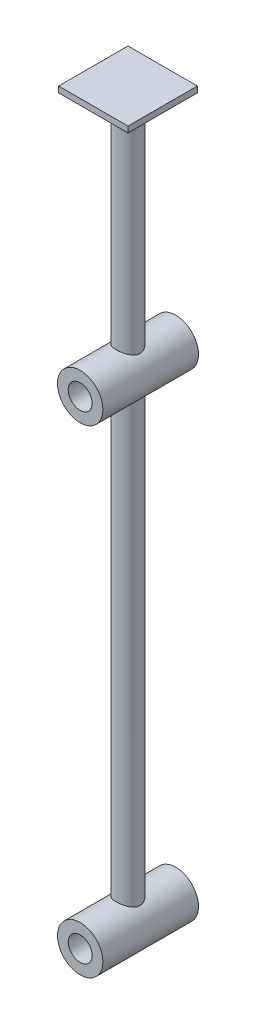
ISO-10303-21;
HEADER;
FILE_DESCRIPTION(('STEP AP214'),'2;1');
FILE_NAME('part.step','',(''),(''),'','','');
FILE_SCHEMA(('AUTOMOTIVE_DESIGN { 1 0 10303 214 1 1 1 1 }'));
ENDSEC;
DATA;
#1=APPLICATION_CONTEXT('core data for automotive mechanical design processes');
#2=APPLICATION_PROTOCOL_DEFINITION('international standard','automotive_design',2000,#1);
#3=PRODUCT_CONTEXT('',#1,'mechanical');
#4=PRODUCT('Part','Part','',(#3));
#5=PRODUCT_RELATED_PRODUCT_CATEGORY('part','',(#4));
#6=PRODUCT_DEFINITION_FORMATION('','',#4);
#7=PRODUCT_DEFINITION_CONTEXT('part definition',#1,'design');
#8=PRODUCT_DEFINITION('design','',#6,#7);
#9=PRODUCT_DEFINITION_SHAPE('','',#8);
#10=(LENGTH_UNIT() NAMED_UNIT(*) SI_UNIT(.MILLI.,.METRE.));
#11=(NAMED_UNIT(*) PLANE_ANGLE_UNIT() SI_UNIT($,.RADIAN.));
#12=(NAMED_UNIT(*) SI_UNIT($,.STERADIAN.) SOLID_ANGLE_UNIT());
#13=UNCERTAINTY_MEASURE_WITH_UNIT(LENGTH_MEASURE(1.E-05),#10,'distance_accuracy_value','');
#14=(GEOMETRIC_REPRESENTATION_CONTEXT(3) GLOBAL_UNCERTAINTY_ASSIGNED_CONTEXT((#13)) GLOBAL_UNIT_ASSIGNED_CONTEXT((#10,
#11,#12)) REPRESENTATION_CONTEXT('',''));
#15=CARTESIAN_POINT('',(0.,0.,0.));
#16=DIRECTION('',(0.,0.,1.));
#17=DIRECTION('',(1.,0.,0.));
#18=AXIS2_PLACEMENT_3D('',#15,#16,#17);
#19=CARTESIAN_POINT('',(0.,0.,40.));
#20=DIRECTION('',(0.,0.,-1.));
#21=DIRECTION('',(-1.,0.,0.));
#22=AXIS2_PLACEMENT_3D('',#19,#20,#21);
#23=CYLINDRICAL_SURFACE('',#22,19.);
#24=CARTESIAN_POINT('',(0.,0.,-40.));
#25=DIRECTION('',(0.,0.,1.));
#26=DIRECTION('',(1.,0.,0.));
#27=AXIS2_PLACEMENT_3D('',#24,#25,#26);
#28=CIRCLE('',#27,19.);
#29=CARTESIAN_POINT('',(19.,0.,-40.));
#30=VERTEX_POINT('',#29);
#31=EDGE_CURVE('E199',#30,#30,#28,.T.);
#32=ORIENTED_EDGE('',*,*,#31,.T.);
#33=EDGE_LOOP('',(#32));
#34=FACE_BOUND('',#33,.T.);
#35=CARTESIAN_POINT('',(0.,0.,40.));
#36=DIRECTION('',(0.,0.,1.));
#37=DIRECTION('',(1.,0.,0.));
#38=AXIS2_PLACEMENT_3D('',#35,#36,#37);
#39=CIRCLE('',#38,19.);
#40=CARTESIAN_POINT('',(19.,0.,40.));
#41=VERTEX_POINT('',#40);
#42=EDGE_CURVE('E203',#41,#41,#39,.T.);
#43=ORIENTED_EDGE('',*,*,#42,.F.);
#44=EDGE_LOOP('',(#43));
#45=FACE_BOUND('',#44,.T.);
#46=CARTESIAN_POINT('',(0.,19.,-10.));
#47=CARTESIAN_POINT('',(-0.261284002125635,19.0000005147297,-10.0000006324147));
#48=CARTESIAN_POINT('',(-0.522560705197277,18.9945987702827,-9.9897489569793));
#49=CARTESIAN_POINT('',(-1.04316816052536,18.9731308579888,-9.94886917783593));
#50=CARTESIAN_POINT('',(-1.30249817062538,18.957060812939,-9.91823366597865));
#51=CARTESIAN_POINT('',(-1.81751271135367,18.9146374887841,-9.8369057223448));
#52=CARTESIAN_POINT('',(-2.07319149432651,18.8882695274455,-9.78618465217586));
#53=CARTESIAN_POINT('',(-2.57867692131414,18.8259203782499,-9.66529653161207));
#54=CARTESIAN_POINT('',(-2.82848403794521,18.7899399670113,-9.59513105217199));
#55=CARTESIAN_POINT('',(-3.31961543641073,18.7094050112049,-9.43644465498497));
#56=CARTESIAN_POINT('',(-3.56096999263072,18.6648858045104,-9.34799927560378));
#57=CARTESIAN_POINT('',(-4.03485602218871,18.5682100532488,-9.15344464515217));
#58=CARTESIAN_POINT('',(-4.26738734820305,18.5160533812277,-9.04733509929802));
#59=CARTESIAN_POINT('',(-4.72235633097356,18.4052752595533,-8.81840050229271));
#60=CARTESIAN_POINT('',(-4.94479706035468,18.3466557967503,-8.69558058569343));
#61=CARTESIAN_POINT('',(-5.37873126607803,18.2241626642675,-8.43406514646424));
#62=CARTESIAN_POINT('',(-5.59022036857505,18.1602869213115,-8.29536335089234));
#63=CARTESIAN_POINT('',(-6.01460634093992,18.024353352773,-7.99353665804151));
#64=CARTESIAN_POINT('',(-6.22670849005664,17.9520335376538,-7.82941208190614));
#65=CARTESIAN_POINT('',(-6.63651342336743,17.804609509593,-7.48520583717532));
#66=CARTESIAN_POINT('',(-6.83421528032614,17.7295051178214,-7.305123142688));
#67=CARTESIAN_POINT('',(-7.21451054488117,17.5781895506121,-6.92980933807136));
#68=CARTESIAN_POINT('',(-7.39709330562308,17.5019776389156,-6.73456773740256));
#69=CARTESIAN_POINT('',(-7.74621354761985,17.3502856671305,-6.32989771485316));
#70=CARTESIAN_POINT('',(-7.91274787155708,17.2748057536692,-6.12046651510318));
#71=CARTESIAN_POINT('',(-8.24291049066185,17.1198877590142,-5.66915875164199));
#72=CARTESIAN_POINT('',(-8.40497498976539,17.0406912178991,-5.42605141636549));
#73=CARTESIAN_POINT('',(-8.70782467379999,16.8879410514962,-4.92537784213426));
#74=CARTESIAN_POINT('',(-8.84861889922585,16.8143850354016,-4.6678178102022));
#75=CARTESIAN_POINT('',(-9.10770883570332,16.6754685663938,-4.13958216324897));
#76=CARTESIAN_POINT('',(-9.22601190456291,16.6101054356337,-3.86891087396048));
#77=CARTESIAN_POINT('',(-9.43882340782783,16.4901048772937,-3.3160680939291));
#78=CARTESIAN_POINT('',(-9.53333475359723,16.4354661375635,-3.03389801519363));
#79=CARTESIAN_POINT('',(-9.69216515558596,16.342273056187,-2.47795243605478));
#80=CARTESIAN_POINT('',(-9.75799252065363,16.3029316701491,-2.20474068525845));
#81=CARTESIAN_POINT('',(-9.86658453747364,16.2374428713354,-1.65219790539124));
#82=CARTESIAN_POINT('',(-9.90935028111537,16.2112948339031,-1.3728671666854));
#83=CARTESIAN_POINT('',(-9.97107137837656,16.1734057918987,-0.810899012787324));
#84=CARTESIAN_POINT('',(-9.9900511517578,16.1616500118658,-0.528265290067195));
#85=CARTESIAN_POINT('',(-10.0039341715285,16.1530610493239,0.0378054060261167));
#86=CARTESIAN_POINT('',(-9.99884019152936,16.1562261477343,0.321242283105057));
#87=CARTESIAN_POINT('',(-9.96701770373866,16.1758715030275,0.847516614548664));
#88=CARTESIAN_POINT('',(-9.94333614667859,16.1904759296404,1.09061653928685));
#89=CARTESIAN_POINT('',(-9.8784085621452,16.230172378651,1.57367261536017));
#90=CARTESIAN_POINT('',(-9.83715681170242,16.2552678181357,1.81362771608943));
#91=CARTESIAN_POINT('',(-9.73759309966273,16.315104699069,2.28870892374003));
#92=CARTESIAN_POINT('',(-9.67928248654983,16.3498453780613,2.52383541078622));
#93=CARTESIAN_POINT('',(-9.54620984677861,16.4278977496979,2.98801042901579));
#94=CARTESIAN_POINT('',(-9.4714412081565,16.4712128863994,3.21705647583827));
#95=CARTESIAN_POINT('',(-9.30431496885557,16.5662050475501,3.67286425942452));
#96=CARTESIAN_POINT('',(-9.21160309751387,16.6180466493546,3.89946183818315));
#97=CARTESIAN_POINT('',(-9.01048616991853,16.7279495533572,4.34404850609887));
#98=CARTESIAN_POINT('',(-8.90207458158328,16.786013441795,4.56203396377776));
#99=CARTESIAN_POINT('',(-8.55432284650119,16.9673731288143,5.20181612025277));
#100=CARTESIAN_POINT('',(-8.29238326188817,17.0978858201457,5.60966156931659));
#101=CARTESIAN_POINT('',(-7.83826688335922,17.3088082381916,6.21592229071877));
#102=CARTESIAN_POINT('',(-7.66424721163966,17.3867412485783,6.42923355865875));
#103=CARTESIAN_POINT('',(-7.2993231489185,17.5430678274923,6.8407160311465));
#104=CARTESIAN_POINT('',(-7.1084231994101,17.6214612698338,7.0388911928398));
#105=CARTESIAN_POINT('',(-6.71045048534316,17.7768258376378,7.41928055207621));
#106=CARTESIAN_POINT('',(-6.5033627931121,17.8537955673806,7.60147968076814));
#107=CARTESIAN_POINT('',(-6.07417007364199,18.0043369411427,7.94862215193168));
#108=CARTESIAN_POINT('',(-5.85207093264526,18.0779098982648,8.11357219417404));
#109=CARTESIAN_POINT('',(-5.38074192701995,18.2239371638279,8.43406097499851));
#110=CARTESIAN_POINT('',(-5.13068725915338,18.2960889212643,8.58852809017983));
#111=CARTESIAN_POINT('',(-4.61627651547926,18.4326014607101,8.87562654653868));
#112=CARTESIAN_POINT('',(-4.35191965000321,18.4969618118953,9.00825668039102));
#113=CARTESIAN_POINT('',(-3.81082956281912,18.6159675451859,9.25015303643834));
#114=CARTESIAN_POINT('',(-3.53410511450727,18.6706196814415,9.35943551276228));
#115=CARTESIAN_POINT('',(-2.97021198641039,18.7685824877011,9.55336065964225));
#116=CARTESIAN_POINT('',(-2.68304466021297,18.811894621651,9.63800651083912));
#117=CARTESIAN_POINT('',(-2.12649785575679,18.882521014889,9.77510765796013));
#118=CARTESIAN_POINT('',(-1.85779198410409,18.9109115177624,9.8297481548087));
#119=CARTESIAN_POINT('',(-1.31585742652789,18.9563295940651,9.91684520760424));
#120=CARTESIAN_POINT('',(-1.04262900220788,18.9733578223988,9.9493030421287));
#121=CARTESIAN_POINT('',(-0.494073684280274,18.9955576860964,9.99157318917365));
#122=CARTESIAN_POINT('',(-0.21874782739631,19.0007348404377,10.0013960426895));
#123=CARTESIAN_POINT('',(0.331732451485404,18.9990971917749,9.9982848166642));
#124=CARTESIAN_POINT('',(0.606886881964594,18.9922830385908,9.9853519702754));
#125=CARTESIAN_POINT('',(1.13052507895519,18.9679853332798,9.93905468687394));
#126=CARTESIAN_POINT('',(1.37922572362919,18.9514930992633,9.90758769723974));
#127=CARTESIAN_POINT('',(1.87276574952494,18.9091005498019,9.82625509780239));
#128=CARTESIAN_POINT('',(2.11760541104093,18.8832009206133,9.77639083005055));
#129=CARTESIAN_POINT('',(2.60184593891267,18.8225914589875,9.65880350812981));
#130=CARTESIAN_POINT('',(2.84124652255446,18.7878811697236,9.59107952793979));
#131=CARTESIAN_POINT('',(3.31316753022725,18.7104279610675,9.43845508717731));
#132=CARTESIAN_POINT('',(3.54568765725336,18.6676846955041,9.35355388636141));
#133=CARTESIAN_POINT('',(4.00844380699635,18.5738933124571,9.16495407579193));
#134=CARTESIAN_POINT('',(4.23846905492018,18.5226606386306,9.06082997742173));
#135=CARTESIAN_POINT('',(4.68883852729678,18.4138142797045,8.83618595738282));
#136=CARTESIAN_POINT('',(4.90917927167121,18.3561983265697,8.71566020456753));
#137=CARTESIAN_POINT('',(5.55406751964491,18.1755666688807,8.3308323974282));
#138=CARTESIAN_POINT('',(5.96273573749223,18.0447135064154,8.04317505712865));
#139=CARTESIAN_POINT('',(6.77145924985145,17.7581098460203,7.37898633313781));
#140=CARTESIAN_POINT('',(7.16603086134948,17.6011898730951,6.99627261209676));
#141=CARTESIAN_POINT('',(7.70723704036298,17.3677103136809,6.37760161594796));
#142=CARTESIAN_POINT('',(7.87931390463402,17.290139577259,6.16375663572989));
#143=CARTESIAN_POINT('',(8.20577824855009,17.1376081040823,5.72194108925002));
#144=CARTESIAN_POINT('',(8.36016292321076,17.0626477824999,5.49396829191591));
#145=CARTESIAN_POINT('',(8.65941013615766,16.9128469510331,5.01005195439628));
#146=CARTESIAN_POINT('',(8.80304472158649,16.8383165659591,4.75325154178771));
#147=CARTESIAN_POINT('',(9.06779974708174,16.6972305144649,4.22633185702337));
#148=CARTESIAN_POINT('',(9.18893102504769,16.6306710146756,3.95621907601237));
#149=CARTESIAN_POINT('',(9.40731953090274,16.508119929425,3.40445109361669));
#150=CARTESIAN_POINT('',(9.50459784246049,16.4521190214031,3.12280634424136));
#151=CARTESIAN_POINT('',(9.67406007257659,16.353049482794,2.54985445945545));
#152=CARTESIAN_POINT('',(9.74624834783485,16.3099786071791,2.2585490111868));
#153=CARTESIAN_POINT('',(9.85856321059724,16.2423087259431,1.69774059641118));
#154=CARTESIAN_POINT('',(9.90113675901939,16.2163141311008,1.42889516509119));
#155=CARTESIAN_POINT('',(9.96424753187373,16.1776128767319,0.887677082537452));
#156=CARTESIAN_POINT('',(9.98478632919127,16.1649052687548,0.615304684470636));
#157=CARTESIAN_POINT('',(10.0034813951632,16.1533427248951,0.0696430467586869));
#158=CARTESIAN_POINT('',(10.0016494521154,16.1544804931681,-0.203645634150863));
#159=CARTESIAN_POINT('',(9.97566176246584,16.1705413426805,-0.748739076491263));
#160=CARTESIAN_POINT('',(9.95150735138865,16.1854635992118,-1.02054392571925));
#161=CARTESIAN_POINT('',(9.88536409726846,16.2259319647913,-1.52887206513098));
#162=CARTESIAN_POINT('',(9.84577155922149,16.2500434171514,-1.76582765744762));
#163=CARTESIAN_POINT('',(9.74992729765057,16.3077296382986,-2.23524548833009));
#164=CARTESIAN_POINT('',(9.6936701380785,16.3413074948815,-2.46770623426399));
#165=CARTESIAN_POINT('',(9.56510209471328,16.4168928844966,-2.92670680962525));
#166=CARTESIAN_POINT('',(9.49279294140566,16.4588995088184,-3.1532472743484));
#167=CARTESIAN_POINT('',(9.33278131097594,16.5501561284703,-3.59936363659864));
#168=CARTESIAN_POINT('',(9.24507274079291,16.5994089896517,-3.81893673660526));
#169=CARTESIAN_POINT('',(8.94751945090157,16.7629148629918,-4.49371460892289));
#170=CARTESIAN_POINT('',(8.71156310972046,16.8877835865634,-4.93512841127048));
#171=CARTESIAN_POINT('',(8.17907054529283,17.1519945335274,-5.77498340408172));
#172=CARTESIAN_POINT('',(7.88250172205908,17.2913445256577,-6.17340129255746));
#173=CARTESIAN_POINT('',(7.37386606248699,17.5119034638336,-6.7606006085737));
#174=CARTESIAN_POINT('',(7.18023518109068,17.5923703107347,-6.96590795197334));
#175=CARTESIAN_POINT('',(6.77605932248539,17.7519622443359,-7.3596581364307));
#176=CARTESIAN_POINT('',(6.5655194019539,17.8310877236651,-7.54810598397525));
#177=CARTESIAN_POINT('',(6.12833263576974,17.9860327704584,-7.907188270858));
#178=CARTESIAN_POINT('',(5.90167343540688,18.0618497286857,-8.07780879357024));
#179=CARTESIAN_POINT('',(5.43345572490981,18.2081771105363,-8.39989878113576));
#180=CARTESIAN_POINT('',(5.19189554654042,18.2786869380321,-8.55136609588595));
#181=CARTESIAN_POINT('',(4.69007445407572,18.4139103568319,-8.83675349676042));
#182=CARTESIAN_POINT('',(4.42953125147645,18.4784750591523,-8.97024902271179));
#183=CARTESIAN_POINT('',(3.89606361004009,18.5982625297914,-9.21448276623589));
#184=CARTESIAN_POINT('',(3.62314535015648,18.6534898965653,-9.3252321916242));
#185=CARTESIAN_POINT('',(3.06737047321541,18.7528865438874,-9.52249972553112));
#186=CARTESIAN_POINT('',(2.78453560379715,18.7970784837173,-9.60906753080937));
#187=CARTESIAN_POINT('',(2.21088063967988,18.8731460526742,-9.75703214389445));
#188=CARTESIAN_POINT('',(1.92006517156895,18.9050286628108,-9.81844322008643));
#189=CARTESIAN_POINT('',(1.3585010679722,18.9532815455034,-9.91101868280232));
#190=CARTESIAN_POINT('',(1.08820229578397,18.9707582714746,-9.9443461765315));
#191=CARTESIAN_POINT('',(0.545266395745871,18.9941173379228,-9.98883671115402));
#192=CARTESIAN_POINT('',(0.272629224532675,18.9999994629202,-9.99999934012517));
#193=CARTESIAN_POINT('',(0.,19.,-10.));
#194=B_SPLINE_CURVE_WITH_KNOTS('',3,(#46,#47,#48,#49,#50,#51,#52,#53,#54,#55,#56,#57,#58,#59,
#60,#61,#62,#63,#64,#65,#66,#67,#68,#69,#70,#71,#72,#73,#74,#75,#76,#77,#78,#79,#80,#81,#82,#83,
#84,#85,#86,#87,#88,#89,#90,#91,#92,#93,#94,#95,#96,#97,#98,#99,#100,#101,#102,#103,#104,#105,
#106,#107,#108,#109,#110,#111,#112,#113,#114,#115,#116,#117,#118,#119,#120,#121,#122,#123,#124,
#125,#126,#127,#128,#129,#130,#131,#132,#133,#134,#135,#136,#137,#138,#139,#140,#141,#142,#143,
#144,#145,#146,#147,#148,#149,#150,#151,#152,#153,#154,#155,#156,#157,#158,#159,#160,#161,#162,
#163,#164,#165,#166,#167,#168,#169,#170,#171,#172,#173,#174,#175,#176,#177,#178,#179,#180,#181,
#182,#183,#184,#185,#186,#187,#188,#189,#190,#191,#192,#193),.UNSPECIFIED.,.T.,.F.,(4,2,2,2,2,2,
2,2,2,2,2,2,2,2,2,2,2,2,2,2,2,2,2,2,2,2,2,2,2,2,2,2,2,2,2,2,2,2,2,2,2,2,2,2,2,2,2,2,2,2,2,2,2,2,
2,2,2,2,2,2,2,2,2,2,2,2,2,2,2,2,2,2,2,4),(0.,0.783584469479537,1.56745387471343,
2.35244498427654,3.13737269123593,3.91911945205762,4.70087926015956,5.48239939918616,
6.26422929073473,7.09665835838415,7.92914097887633,8.7622049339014,9.59543245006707,
10.5024590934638,11.4090991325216,12.3154420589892,13.221674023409,14.071734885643,
14.9217554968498,15.7709027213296,16.6199521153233,17.3531458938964,18.0865786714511,
18.8199534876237,19.553623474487,20.3036140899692,21.0539176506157,22.5538035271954,
23.4114231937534,24.2688178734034,25.1270127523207,25.9848730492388,26.8916087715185,
27.7983946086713,28.7045470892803,29.6105825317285,30.4364704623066,31.2623107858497,
32.087766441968,32.9131773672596,33.6659770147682,34.4187217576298,35.1715055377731,
35.9243217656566,36.6964057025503,37.4687648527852,39.0126504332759,40.7198458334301,
41.5748048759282,42.4298992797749,43.3393150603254,44.2482917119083,45.1564619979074,
46.0644745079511,46.8835924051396,47.7026518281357,48.5212796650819,49.3398585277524,
50.0633953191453,50.7871683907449,51.5108634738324,52.2348455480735,53.7760426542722,
55.318070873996,56.197603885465,57.0768748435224,57.9568271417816,58.836878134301,
59.7350141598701,60.6327065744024,61.5285402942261,62.4238652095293,63.2414585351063,
64.0590670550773),.UNSPECIFIED.);
#195=CARTESIAN_POINT('',(0.,19.,-10.));
#196=VERTEX_POINT('',#195);
#197=EDGE_CURVE('E11',#196,#196,#194,.T.);
#198=ORIENTED_EDGE('',*,*,#197,.F.);
#199=EDGE_LOOP('',(#198));
#200=FACE_BOUND('',#199,.T.);
#201=ADVANCED_FACE('F32',(#34,#45,#200),#23,.T.);
#202=CARTESIAN_POINT('',(0.,0.,40.));
#203=DIRECTION('',(0.,0.,-1.));
#204=DIRECTION('',(-1.,0.,0.));
#205=AXIS2_PLACEMENT_3D('',#202,#203,#204);
#206=CYLINDRICAL_SURFACE('',#205,10.);
#207=CARTESIAN_POINT('',(0.,0.,-40.));
#208=DIRECTION('',(0.,0.,1.));
#209=DIRECTION('',(1.,0.,0.));
#210=AXIS2_PLACEMENT_3D('',#207,#208,#209);
#211=CIRCLE('',#210,10.);
#212=CARTESIAN_POINT('',(10.,0.,-40.));
#213=VERTEX_POINT('',#212);
#214=EDGE_CURVE('E136',#213,#213,#211,.T.);
#215=ORIENTED_EDGE('',*,*,#214,.F.);
#216=EDGE_LOOP('',(#215));
#217=FACE_BOUND('',#216,.T.);
#218=CARTESIAN_POINT('',(0.,0.,40.));
#219=DIRECTION('',(0.,0.,1.));
#220=DIRECTION('',(1.,0.,0.));
#221=AXIS2_PLACEMENT_3D('',#218,#219,#220);
#222=CIRCLE('',#221,10.);
#223=CARTESIAN_POINT('',(10.,0.,40.));
#224=VERTEX_POINT('',#223);
#225=EDGE_CURVE('E345',#224,#224,#222,.T.);
#226=ORIENTED_EDGE('',*,*,#225,.T.);
#227=EDGE_LOOP('',(#226));
#228=FACE_BOUND('',#227,.T.);
#229=CARTESIAN_POINT('',(0.,0.,0.));
#230=DIRECTION('',(0.,0.707106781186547,-0.707106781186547));
#231=DIRECTION('',(0.,-0.707106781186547,-0.707106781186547));
#232=AXIS2_PLACEMENT_3D('',#229,#230,#231);
#233=ELLIPSE('',#232,14.1421356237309,10.);
#234=CARTESIAN_POINT('',(-10.,0.,0.));
#235=VERTEX_POINT('',#234);
#236=CARTESIAN_POINT('',(10.,0.,0.));
#237=VERTEX_POINT('',#236);
#238=EDGE_CURVE('E58',#235,#237,#233,.T.);
#239=ORIENTED_EDGE('',*,*,#238,.T.);
#240=CARTESIAN_POINT('',(0.,0.,0.));
#241=DIRECTION('',(0.,-0.707106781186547,-0.707106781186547));
#242=DIRECTION('',(0.,0.707106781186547,-0.707106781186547));
#243=AXIS2_PLACEMENT_3D('',#240,#241,#242);
#244=ELLIPSE('',#243,14.1421356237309,10.);
#245=EDGE_CURVE('E45',#237,#235,#244,.F.);
#246=ORIENTED_EDGE('',*,*,#245,.T.);
#247=EDGE_LOOP('',(#239,#246));
#248=FACE_BOUND('',#247,.T.);
#249=ADVANCED_FACE('F189',(#217,#228,#248),#206,.F.);
#250=CARTESIAN_POINT('',(0.,0.,40.));
#251=DIRECTION('',(0.,0.,1.));
#252=DIRECTION('',(1.,0.,0.));
#253=AXIS2_PLACEMENT_3D('',#250,#251,#252);
#254=PLANE('',#253);
#255=ORIENTED_EDGE('',*,*,#42,.T.);
#256=EDGE_LOOP('',(#255));
#257=FACE_BOUND('',#256,.T.);
#258=ORIENTED_EDGE('',*,*,#225,.F.);
#259=EDGE_LOOP('',(#258));
#260=FACE_BOUND('',#259,.T.);
#261=ADVANCED_FACE('F194',(#257,#260),#254,.T.);
#262=CARTESIAN_POINT('',(0.,0.,-40.));
#263=DIRECTION('',(0.,0.,1.));
#264=DIRECTION('',(1.,0.,0.));
#265=AXIS2_PLACEMENT_3D('',#262,#263,#264);
#266=PLANE('',#265);
#267=ORIENTED_EDGE('',*,*,#214,.T.);
#268=EDGE_LOOP('',(#267));
#269=FACE_BOUND('',#268,.T.);
#270=ORIENTED_EDGE('',*,*,#31,.F.);
#271=EDGE_LOOP('',(#270));
#272=FACE_BOUND('',#271,.T.);
#273=ADVANCED_FACE('F151',(#269,#272),#266,.F.);
#274=CARTESIAN_POINT('',(0.,600.,0.));
#275=DIRECTION('',(0.,-1.,0.));
#276=DIRECTION('',(0.,0.,-1.));
#277=AXIS2_PLACEMENT_3D('',#274,#275,#276);
#278=CYLINDRICAL_SURFACE('',#277,10.);
#279=ORIENTED_EDGE('',*,*,#245,.F.);
#280=CARTESIAN_POINT('',(0.,0.,0.));
#281=DIRECTION('',(0.,1.,0.));
#282=DIRECTION('',(0.,0.,1.));
#283=AXIS2_PLACEMENT_3D('',#280,#281,#282);
#284=CIRCLE('',#283,10.);
#285=EDGE_CURVE('E52',#237,#235,#284,.T.);
#286=ORIENTED_EDGE('',*,*,#285,.T.);
#287=EDGE_LOOP('',(#279,#286));
#288=FACE_BOUND('',#287,.T.);
#289=ADVANCED_FACE('F149',(#288),#278,.T.);
#290=CARTESIAN_POINT('',(0.,0.,0.));
#291=DIRECTION('',(0.,1.,0.));
#292=DIRECTION('',(0.,0.,1.));
#293=AXIS2_PLACEMENT_3D('',#290,#291,#292);
#294=PLANE('',#293);
#295=ORIENTED_EDGE('',*,*,#285,.F.);
#296=EDGE_CURVE('E104',#235,#237,#284,.T.);
#297=ORIENTED_EDGE('',*,*,#296,.F.);
#298=EDGE_LOOP('',(#295,#297));
#299=FACE_BOUND('',#298,.T.);
#300=ADVANCED_FACE('F147',(#299),#294,.F.);
#301=ORIENTED_EDGE('',*,*,#238,.F.);
#302=ORIENTED_EDGE('',*,*,#296,.T.);
#303=EDGE_LOOP('',(#301,#302));
#304=FACE_BOUND('',#303,.T.);
#305=ADVANCED_FACE('F141',(#304),#278,.T.);
#306=CARTESIAN_POINT('',(0.,381.,-10.));
#307=CARTESIAN_POINT('',(0.261284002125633,380.99999948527,-10.0000006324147));
#308=CARTESIAN_POINT('',(0.522560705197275,381.005401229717,-9.9897489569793));
#309=CARTESIAN_POINT('',(1.04316816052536,381.026869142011,-9.94886917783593));
#310=CARTESIAN_POINT('',(1.30249817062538,381.042939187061,-9.91823366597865));
#311=CARTESIAN_POINT('',(1.81751271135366,381.085362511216,-9.8369057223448));
#312=CARTESIAN_POINT('',(2.07319149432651,381.111730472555,-9.78618465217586));
#313=CARTESIAN_POINT('',(2.57867692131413,381.17407962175,-9.66529653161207));
#314=CARTESIAN_POINT('',(2.8284840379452,381.210060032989,-9.59513105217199));
#315=CARTESIAN_POINT('',(3.31961543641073,381.290594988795,-9.43644465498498));
#316=CARTESIAN_POINT('',(3.56096999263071,381.33511419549,-9.34799927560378));
#317=CARTESIAN_POINT('',(4.0348560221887,381.431789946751,-9.15344464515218));
#318=CARTESIAN_POINT('',(4.26738734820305,381.483946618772,-9.04733509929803));
#319=CARTESIAN_POINT('',(4.72235633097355,381.594724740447,-8.81840050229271));
#320=CARTESIAN_POINT('',(4.94479706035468,381.65334420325,-8.69558058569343));
#321=CARTESIAN_POINT('',(5.37873126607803,381.775837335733,-8.43406514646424));
#322=CARTESIAN_POINT('',(5.59022036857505,381.839713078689,-8.29536335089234));
#323=CARTESIAN_POINT('',(6.01460634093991,381.975646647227,-7.99353665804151));
#324=CARTESIAN_POINT('',(6.22670849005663,382.047966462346,-7.82941208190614));
#325=CARTESIAN_POINT('',(6.63651342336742,382.195390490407,-7.48520583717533));
#326=CARTESIAN_POINT('',(6.83421528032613,382.270494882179,-7.305123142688));
#327=CARTESIAN_POINT('',(7.21451054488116,382.421810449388,-6.92980933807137));
#328=CARTESIAN_POINT('',(7.39709330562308,382.498022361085,-6.73456773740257));
#329=CARTESIAN_POINT('',(7.74621354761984,382.64971433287,-6.32989771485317));
#330=CARTESIAN_POINT('',(7.91274787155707,382.725194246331,-6.12046651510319));
#331=CARTESIAN_POINT('',(8.24291049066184,382.880112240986,-5.669158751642));
#332=CARTESIAN_POINT('',(8.40497498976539,382.959308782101,-5.42605141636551));
#333=CARTESIAN_POINT('',(8.70782467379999,383.112058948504,-4.92537784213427));
#334=CARTESIAN_POINT('',(8.84861889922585,383.185614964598,-4.66781781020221));
#335=CARTESIAN_POINT('',(9.10770883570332,383.324531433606,-4.13958216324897));
#336=CARTESIAN_POINT('',(9.22601190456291,383.389894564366,-3.86891087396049));
#337=CARTESIAN_POINT('',(9.43882340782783,383.509895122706,-3.3160680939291));
#338=CARTESIAN_POINT('',(9.53333475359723,383.564533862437,-3.03389801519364));
#339=CARTESIAN_POINT('',(9.69216515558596,383.657726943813,-2.47795243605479));
#340=CARTESIAN_POINT('',(9.75799252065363,383.697068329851,-2.20474068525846));
#341=CARTESIAN_POINT('',(9.86658453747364,383.762557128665,-1.65219790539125));
#342=CARTESIAN_POINT('',(9.90935028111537,383.788705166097,-1.37286716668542));
#343=CARTESIAN_POINT('',(9.97107137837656,383.826594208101,-0.810899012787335));
#344=CARTESIAN_POINT('',(9.9900511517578,383.838349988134,-0.528265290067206));
#345=CARTESIAN_POINT('',(10.0039341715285,383.846938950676,0.0378054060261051));
#346=CARTESIAN_POINT('',(9.99884019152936,383.843773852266,0.321242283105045));
#347=CARTESIAN_POINT('',(9.96701770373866,383.824128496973,0.847516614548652));
#348=CARTESIAN_POINT('',(9.94333614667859,383.80952407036,1.09061653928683));
#349=CARTESIAN_POINT('',(9.8784085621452,383.769827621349,1.57367261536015));
#350=CARTESIAN_POINT('',(9.83715681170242,383.744732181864,1.81362771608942));
#351=CARTESIAN_POINT('',(9.73759309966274,383.684895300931,2.28870892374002));
#352=CARTESIAN_POINT('',(9.67928248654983,383.650154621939,2.5238354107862));
#353=CARTESIAN_POINT('',(9.54620984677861,383.572102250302,2.98801042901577));
#354=CARTESIAN_POINT('',(9.4714412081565,383.528787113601,3.21705647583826));
#355=CARTESIAN_POINT('',(9.30431496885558,383.43379495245,3.67286425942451));
#356=CARTESIAN_POINT('',(9.21160309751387,383.381953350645,3.89946183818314));
#357=CARTESIAN_POINT('',(9.01048616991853,383.272050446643,4.34404850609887));
#358=CARTESIAN_POINT('',(8.90207458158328,383.213986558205,4.56203396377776));
#359=CARTESIAN_POINT('',(8.5543228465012,383.032626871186,5.20181612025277));
#360=CARTESIAN_POINT('',(8.29238326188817,382.902114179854,5.60966156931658));
#361=CARTESIAN_POINT('',(7.83826688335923,382.691191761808,6.21592229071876));
#362=CARTESIAN_POINT('',(7.66424721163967,382.613258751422,6.42923355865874));
#363=CARTESIAN_POINT('',(7.29932314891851,382.456932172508,6.8407160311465));
#364=CARTESIAN_POINT('',(7.1084231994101,382.378538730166,7.03889119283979));
#365=CARTESIAN_POINT('',(6.71045048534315,382.223174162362,7.41928055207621));
#366=CARTESIAN_POINT('',(6.5033627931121,382.146204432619,7.60147968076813));
#367=CARTESIAN_POINT('',(6.07417007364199,381.995663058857,7.94862215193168));
#368=CARTESIAN_POINT('',(5.85207093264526,381.922090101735,8.11357219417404));
#369=CARTESIAN_POINT('',(5.38074192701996,381.776062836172,8.43406097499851));
#370=CARTESIAN_POINT('',(5.13068725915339,381.703911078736,8.58852809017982));
#371=CARTESIAN_POINT('',(4.61627651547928,381.56739853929,8.87562654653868));
#372=CARTESIAN_POINT('',(4.35191965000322,381.503038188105,9.00825668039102));
#373=CARTESIAN_POINT('',(3.81082956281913,381.384032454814,9.25015303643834));
#374=CARTESIAN_POINT('',(3.53410511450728,381.329380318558,9.35943551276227));
#375=CARTESIAN_POINT('',(2.9702119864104,381.231417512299,9.55336065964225));
#376=CARTESIAN_POINT('',(2.68304466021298,381.188105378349,9.63800651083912));
#377=CARTESIAN_POINT('',(2.12649785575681,381.117478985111,9.77510765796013));
#378=CARTESIAN_POINT('',(1.85779198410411,381.089088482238,9.82974815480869));
#379=CARTESIAN_POINT('',(1.31585742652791,381.043670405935,9.91684520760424));
#380=CARTESIAN_POINT('',(1.0426290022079,381.026642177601,9.9493030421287));
#381=CARTESIAN_POINT('',(0.49407368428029,381.004442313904,9.99157318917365));
#382=CARTESIAN_POINT('',(0.218747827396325,380.999265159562,10.0013960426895));
#383=CARTESIAN_POINT('',(-0.33173245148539,381.000902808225,9.9982848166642));
#384=CARTESIAN_POINT('',(-0.606886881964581,381.007716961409,9.9853519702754));
#385=CARTESIAN_POINT('',(-1.13052507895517,381.03201466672,9.93905468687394));
#386=CARTESIAN_POINT('',(-1.37922572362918,381.048506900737,9.90758769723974));
#387=CARTESIAN_POINT('',(-1.87276574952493,381.090899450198,9.82625509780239));
#388=CARTESIAN_POINT('',(-2.11760541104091,381.116799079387,9.77639083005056));
#389=CARTESIAN_POINT('',(-2.60184593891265,381.177408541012,9.65880350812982));
#390=CARTESIAN_POINT('',(-2.84124652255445,381.212118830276,9.5910795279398));
#391=CARTESIAN_POINT('',(-3.31316753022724,381.289572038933,9.43845508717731));
#392=CARTESIAN_POINT('',(-3.54568765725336,381.332315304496,9.35355388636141));
#393=CARTESIAN_POINT('',(-4.00844380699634,381.426106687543,9.16495407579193));
#394=CARTESIAN_POINT('',(-4.23846905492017,381.477339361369,9.06082997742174));
#395=CARTESIAN_POINT('',(-4.68883852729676,381.586185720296,8.83618595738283));
#396=CARTESIAN_POINT('',(-4.9091792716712,381.64380167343,8.71566020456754));
#397=CARTESIAN_POINT('',(-5.5540675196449,381.824433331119,8.33083239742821));
#398=CARTESIAN_POINT('',(-5.96273573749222,381.955286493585,8.04317505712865));
#399=CARTESIAN_POINT('',(-6.77145924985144,382.24189015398,7.37898633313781));
#400=CARTESIAN_POINT('',(-7.16603086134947,382.398810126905,6.99627261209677));
#401=CARTESIAN_POINT('',(-7.70723704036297,382.632289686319,6.37760161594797));
#402=CARTESIAN_POINT('',(-7.87931390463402,382.709860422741,6.16375663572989));
#403=CARTESIAN_POINT('',(-8.20577824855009,382.862391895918,5.72194108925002));
#404=CARTESIAN_POINT('',(-8.36016292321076,382.9373522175,5.49396829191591));
#405=CARTESIAN_POINT('',(-8.65941013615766,383.087153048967,5.01005195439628));
#406=CARTESIAN_POINT('',(-8.80304472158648,383.161683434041,4.75325154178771));
#407=CARTESIAN_POINT('',(-9.06779974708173,383.302769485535,4.22633185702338));
#408=CARTESIAN_POINT('',(-9.18893102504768,383.369328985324,3.95621907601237));
#409=CARTESIAN_POINT('',(-9.40731953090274,383.491880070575,3.40445109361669));
#410=CARTESIAN_POINT('',(-9.50459784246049,383.547880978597,3.12280634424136));
#411=CARTESIAN_POINT('',(-9.67406007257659,383.646950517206,2.54985445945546));
#412=CARTESIAN_POINT('',(-9.74624834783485,383.690021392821,2.25854901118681));
#413=CARTESIAN_POINT('',(-9.85856321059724,383.757691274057,1.69774059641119));
#414=CARTESIAN_POINT('',(-9.90113675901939,383.783685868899,1.4288951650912));
#415=CARTESIAN_POINT('',(-9.96424753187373,383.822387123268,0.887677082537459));
#416=CARTESIAN_POINT('',(-9.98478632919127,383.835094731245,0.615304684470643));
#417=CARTESIAN_POINT('',(-10.0034813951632,383.846657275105,0.0696430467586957));
#418=CARTESIAN_POINT('',(-10.0016494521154,383.845519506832,-0.203645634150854));
#419=CARTESIAN_POINT('',(-9.97566176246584,383.829458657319,-0.748739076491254));
#420=CARTESIAN_POINT('',(-9.95150735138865,383.814536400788,-1.02054392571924));
#421=CARTESIAN_POINT('',(-9.88536409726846,383.774068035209,-1.52887206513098));
#422=CARTESIAN_POINT('',(-9.84577155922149,383.749956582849,-1.76582765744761));
#423=CARTESIAN_POINT('',(-9.74992729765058,383.692270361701,-2.23524548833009));
#424=CARTESIAN_POINT('',(-9.6936701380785,383.658692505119,-2.46770623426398));
#425=CARTESIAN_POINT('',(-9.56510209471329,383.583107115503,-2.92670680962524));
#426=CARTESIAN_POINT('',(-9.49279294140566,383.541100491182,-3.1532472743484));
#427=CARTESIAN_POINT('',(-9.33278131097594,383.44984387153,-3.59936363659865));
#428=CARTESIAN_POINT('',(-9.24507274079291,383.400591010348,-3.81893673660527));
#429=CARTESIAN_POINT('',(-8.94751945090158,383.237085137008,-4.49371460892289));
#430=CARTESIAN_POINT('',(-8.71156310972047,383.112216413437,-4.93512841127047));
#431=CARTESIAN_POINT('',(-8.17907054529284,382.848005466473,-5.77498340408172));
#432=CARTESIAN_POINT('',(-7.88250172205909,382.708655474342,-6.17340129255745));
#433=CARTESIAN_POINT('',(-7.373866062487,382.488096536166,-6.76060060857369));
#434=CARTESIAN_POINT('',(-7.18023518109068,382.407629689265,-6.96590795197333));
#435=CARTESIAN_POINT('',(-6.77605932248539,382.248037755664,-7.3596581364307));
#436=CARTESIAN_POINT('',(-6.56551940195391,382.168912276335,-7.54810598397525));
#437=CARTESIAN_POINT('',(-6.12833263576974,382.013967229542,-7.907188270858));
#438=CARTESIAN_POINT('',(-5.90167343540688,381.938150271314,-8.07780879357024));
#439=CARTESIAN_POINT('',(-5.4334557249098,381.791822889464,-8.39989878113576));
#440=CARTESIAN_POINT('',(-5.19189554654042,381.721313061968,-8.55136609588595));
#441=CARTESIAN_POINT('',(-4.69007445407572,381.586089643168,-8.83675349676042));
#442=CARTESIAN_POINT('',(-4.42953125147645,381.521524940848,-8.97024902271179));
#443=CARTESIAN_POINT('',(-3.8960636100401,381.401737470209,-9.21448276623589));
#444=CARTESIAN_POINT('',(-3.62314535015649,381.346510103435,-9.3252321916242));
#445=CARTESIAN_POINT('',(-3.06737047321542,381.247113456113,-9.52249972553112));
#446=CARTESIAN_POINT('',(-2.78453560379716,381.202921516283,-9.60906753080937));
#447=CARTESIAN_POINT('',(-2.2108806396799,381.126853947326,-9.75703214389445));
#448=CARTESIAN_POINT('',(-1.92006517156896,381.094971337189,-9.81844322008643));
#449=CARTESIAN_POINT('',(-1.35850106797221,381.046718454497,-9.91101868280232));
#450=CARTESIAN_POINT('',(-1.08820229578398,381.029241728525,-9.9443461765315));
#451=CARTESIAN_POINT('',(-0.545266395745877,381.005882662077,-9.98883671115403));
#452=CARTESIAN_POINT('',(-0.272629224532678,381.00000053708,-9.99999934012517));
#453=CARTESIAN_POINT('',(0.,381.,-10.));
#454=B_SPLINE_CURVE_WITH_KNOTS('',3,(#306,#307,#308,#309,#310,#311,#312,#313,#314,#315,#316,
#317,#318,#319,#320,#321,#322,#323,#324,#325,#326,#327,#328,#329,#330,#331,#332,#333,#334,#335,
#336,#337,#338,#339,#340,#341,#342,#343,#344,#345,#346,#347,#348,#349,#350,#351,#352,#353,#354,
#355,#356,#357,#358,#359,#360,#361,#362,#363,#364,#365,#366,#367,#368,#369,#370,#371,#372,#373,
#374,#375,#376,#377,#378,#379,#380,#381,#382,#383,#384,#385,#386,#387,#388,#389,#390,#391,#392,
#393,#394,#395,#396,#397,#398,#399,#400,#401,#402,#403,#404,#405,#406,#407,#408,#409,#410,#411,
#412,#413,#414,#415,#416,#417,#418,#419,#420,#421,#422,#423,#424,#425,#426,#427,#428,#429,#430,
#431,#432,#433,#434,#435,#436,#437,#438,#439,#440,#441,#442,#443,#444,#445,#446,#447,#448,#449,
#450,#451,#452,#453),.UNSPECIFIED.,.T.,.F.,(4,2,2,2,2,2,2,2,2,2,2,2,2,2,2,2,2,2,2,2,2,2,2,2,2,2,
2,2,2,2,2,2,2,2,2,2,2,2,2,2,2,2,2,2,2,2,2,2,2,2,2,2,2,2,2,2,2,2,2,2,2,2,2,2,2,2,2,2,2,2,2,2,2,
4),(0.,0.783584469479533,1.56745387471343,2.35244498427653,3.13737269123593,3.91911945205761,
4.70087926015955,5.48239939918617,6.26422929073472,7.09665835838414,7.92914097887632,
8.76220493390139,9.59543245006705,10.5024590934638,11.4090991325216,12.3154420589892,
13.221674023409,14.071734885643,14.9217554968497,15.7709027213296,16.6199521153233,
17.3531458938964,18.0865786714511,18.8199534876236,19.553623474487,20.3036140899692,
21.0539176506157,22.5538035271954,23.4114231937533,24.2688178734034,25.1270127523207,
25.9848730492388,26.8916087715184,27.7983946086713,28.7045470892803,29.6105825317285,
30.4364704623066,31.2623107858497,32.087766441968,32.9131773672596,33.6659770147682,
34.4187217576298,35.1715055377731,35.9243217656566,36.6964057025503,37.4687648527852,
39.0126504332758,40.7198458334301,41.5748048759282,42.4298992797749,43.3393150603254,
44.2482917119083,45.1564619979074,46.0644745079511,46.8835924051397,47.7026518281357,
48.5212796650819,49.3398585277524,50.0633953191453,50.7871683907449,51.5108634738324,
52.2348455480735,53.7760426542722,55.318070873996,56.197603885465,57.0768748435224,
57.9568271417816,58.836878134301,59.7350141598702,60.6327065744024,61.5285402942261,
62.4238652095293,63.2414585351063,64.0590670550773),.UNSPECIFIED.);
#455=CARTESIAN_POINT('',(0.,381.,-10.));
#456=VERTEX_POINT('',#455);
#457=EDGE_CURVE('E113',#456,#456,#454,.T.);
#458=ORIENTED_EDGE('',*,*,#457,.T.);
#459=EDGE_LOOP('',(#458));
#460=FACE_BOUND('',#459,.T.);
#461=ORIENTED_EDGE('',*,*,#197,.T.);
#462=EDGE_LOOP('',(#461));
#463=FACE_BOUND('',#462,.T.);
#464=ADVANCED_FACE('F146',(#460,#463),#278,.T.);
#465=CARTESIAN_POINT('',(0.,400.,-93.7401153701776));
#466=DIRECTION('',(0.,0.,1.));
#467=DIRECTION('',(1.,0.,0.));
#468=AXIS2_PLACEMENT_3D('',#465,#466,#467);
#469=CYLINDRICAL_SURFACE('',#468,19.);
#470=ORIENTED_EDGE('',*,*,#457,.F.);
#471=EDGE_LOOP('',(#470));
#472=FACE_BOUND('',#471,.T.);
#473=CARTESIAN_POINT('',(0.,400.,-40.));
#474=DIRECTION('',(0.,0.,1.));
#475=DIRECTION('',(1.,0.,0.));
#476=AXIS2_PLACEMENT_3D('',#473,#474,#475);
#477=CIRCLE('',#476,19.);
#478=CARTESIAN_POINT('',(19.,400.,-40.));
#479=VERTEX_POINT('',#478);
#480=EDGE_CURVE('E115',#479,#479,#477,.F.);
#481=ORIENTED_EDGE('',*,*,#480,.F.);
#482=EDGE_LOOP('',(#481));
#483=FACE_BOUND('',#482,.T.);
#484=CARTESIAN_POINT('',(0.,400.,40.));
#485=DIRECTION('',(0.,0.,1.));
#486=DIRECTION('',(1.,0.,0.));
#487=AXIS2_PLACEMENT_3D('',#484,#485,#486);
#488=CIRCLE('',#487,19.);
#489=CARTESIAN_POINT('',(19.,400.,40.));
#490=VERTEX_POINT('',#489);
#491=EDGE_CURVE('E240',#490,#490,#488,.T.);
#492=ORIENTED_EDGE('',*,*,#491,.F.);
#493=EDGE_LOOP('',(#492));
#494=FACE_BOUND('',#493,.T.);
#495=CARTESIAN_POINT('',(0.,419.,-10.));
#496=CARTESIAN_POINT('',(-0.261284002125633,419.00000051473,-10.0000006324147));
#497=CARTESIAN_POINT('',(-0.522560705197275,418.994598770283,-9.9897489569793));
#498=CARTESIAN_POINT('',(-1.04316816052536,418.973130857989,-9.94886917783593));
#499=CARTESIAN_POINT('',(-1.30249817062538,418.957060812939,-9.91823366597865));
#500=CARTESIAN_POINT('',(-1.81751271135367,418.914637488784,-9.8369057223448));
#501=CARTESIAN_POINT('',(-2.07319149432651,418.888269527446,-9.78618465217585));
#502=CARTESIAN_POINT('',(-2.57867692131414,418.82592037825,-9.66529653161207));
#503=CARTESIAN_POINT('',(-2.8284840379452,418.789939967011,-9.59513105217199));
#504=CARTESIAN_POINT('',(-3.31961543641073,418.709405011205,-9.43644465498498));
#505=CARTESIAN_POINT('',(-3.56096999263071,418.66488580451,-9.34799927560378));
#506=CARTESIAN_POINT('',(-4.0348560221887,418.568210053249,-9.15344464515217));
#507=CARTESIAN_POINT('',(-4.26738734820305,418.516053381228,-9.04733509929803));
#508=CARTESIAN_POINT('',(-4.72235633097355,418.405275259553,-8.81840050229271));
#509=CARTESIAN_POINT('',(-4.94479706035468,418.34665579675,-8.69558058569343));
#510=CARTESIAN_POINT('',(-5.37873126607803,418.224162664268,-8.43406514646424));
#511=CARTESIAN_POINT('',(-5.59022036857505,418.160286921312,-8.29536335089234));
#512=CARTESIAN_POINT('',(-6.01460634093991,418.024353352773,-7.99353665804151));
#513=CARTESIAN_POINT('',(-6.22670849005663,417.952033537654,-7.82941208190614));
#514=CARTESIAN_POINT('',(-6.63651342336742,417.804609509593,-7.48520583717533));
#515=CARTESIAN_POINT('',(-6.83421528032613,417.729505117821,-7.305123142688));
#516=CARTESIAN_POINT('',(-7.21451054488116,417.578189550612,-6.92980933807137));
#517=CARTESIAN_POINT('',(-7.39709330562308,417.501977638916,-6.73456773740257));
#518=CARTESIAN_POINT('',(-7.74621354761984,417.35028566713,-6.32989771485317));
#519=CARTESIAN_POINT('',(-7.91274787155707,417.274805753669,-6.12046651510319));
#520=CARTESIAN_POINT('',(-8.24291049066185,417.119887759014,-5.66915875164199));
#521=CARTESIAN_POINT('',(-8.40497498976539,417.040691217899,-5.42605141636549));
#522=CARTESIAN_POINT('',(-8.7078246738,416.887941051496,-4.92537784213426));
#523=CARTESIAN_POINT('',(-8.84861889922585,416.814385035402,-4.6678178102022));
#524=CARTESIAN_POINT('',(-9.10770883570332,416.675468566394,-4.13958216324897));
#525=CARTESIAN_POINT('',(-9.22601190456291,416.610105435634,-3.86891087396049));
#526=CARTESIAN_POINT('',(-9.43882340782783,416.490104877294,-3.3160680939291));
#527=CARTESIAN_POINT('',(-9.53333475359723,416.435466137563,-3.03389801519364));
#528=CARTESIAN_POINT('',(-9.69216515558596,416.342273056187,-2.47795243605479));
#529=CARTESIAN_POINT('',(-9.75799252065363,416.302931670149,-2.20474068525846));
#530=CARTESIAN_POINT('',(-9.86658453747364,416.237442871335,-1.65219790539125));
#531=CARTESIAN_POINT('',(-9.90935028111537,416.211294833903,-1.37286716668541));
#532=CARTESIAN_POINT('',(-9.97107137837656,416.173405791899,-0.810899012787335));
#533=CARTESIAN_POINT('',(-9.9900511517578,416.161650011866,-0.528265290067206));
#534=CARTESIAN_POINT('',(-10.0039341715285,416.153061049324,0.0378054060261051));
#535=CARTESIAN_POINT('',(-9.99884019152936,416.156226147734,0.321242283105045));
#536=CARTESIAN_POINT('',(-9.96701770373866,416.175871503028,0.847516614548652));
#537=CARTESIAN_POINT('',(-9.94333614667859,416.19047592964,1.09061653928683));
#538=CARTESIAN_POINT('',(-9.8784085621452,416.230172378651,1.57367261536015));
#539=CARTESIAN_POINT('',(-9.83715681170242,416.255267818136,1.81362771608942));
#540=CARTESIAN_POINT('',(-9.73759309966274,416.315104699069,2.28870892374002));
#541=CARTESIAN_POINT('',(-9.67928248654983,416.349845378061,2.5238354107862));
#542=CARTESIAN_POINT('',(-9.54620984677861,416.427897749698,2.98801042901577));
#543=CARTESIAN_POINT('',(-9.4714412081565,416.471212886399,3.21705647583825));
#544=CARTESIAN_POINT('',(-9.30431496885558,416.56620504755,3.67286425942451));
#545=CARTESIAN_POINT('',(-9.21160309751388,416.618046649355,3.89946183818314));
#546=CARTESIAN_POINT('',(-9.01048616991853,416.727949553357,4.34404850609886));
#547=CARTESIAN_POINT('',(-8.90207458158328,416.786013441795,4.56203396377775));
#548=CARTESIAN_POINT('',(-8.5543228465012,416.967373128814,5.20181612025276));
#549=CARTESIAN_POINT('',(-8.29238326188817,417.097885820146,5.60966156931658));
#550=CARTESIAN_POINT('',(-7.83826688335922,417.308808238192,6.21592229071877));
#551=CARTESIAN_POINT('',(-7.66424721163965,417.386741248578,6.42923355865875));
#552=CARTESIAN_POINT('',(-7.29932314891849,417.543067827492,6.84071603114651));
#553=CARTESIAN_POINT('',(-7.1084231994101,417.621461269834,7.0388911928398));
#554=CARTESIAN_POINT('',(-6.71045048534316,417.776825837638,7.41928055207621));
#555=CARTESIAN_POINT('',(-6.5033627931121,417.853795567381,7.60147968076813));
#556=CARTESIAN_POINT('',(-6.07417007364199,418.004336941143,7.94862215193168));
#557=CARTESIAN_POINT('',(-5.85207093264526,418.077909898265,8.11357219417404));
#558=CARTESIAN_POINT('',(-5.38074192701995,418.223937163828,8.43406097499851));
#559=CARTESIAN_POINT('',(-5.13068725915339,418.296088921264,8.58852809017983));
#560=CARTESIAN_POINT('',(-4.61627651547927,418.43260146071,8.87562654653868));
#561=CARTESIAN_POINT('',(-4.35191965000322,418.496961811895,9.00825668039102));
#562=CARTESIAN_POINT('',(-3.81082956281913,418.615967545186,9.25015303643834));
#563=CARTESIAN_POINT('',(-3.53410511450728,418.670619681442,9.35943551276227));
#564=CARTESIAN_POINT('',(-2.9702119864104,418.768582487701,9.55336065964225));
#565=CARTESIAN_POINT('',(-2.68304466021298,418.811894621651,9.63800651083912));
#566=CARTESIAN_POINT('',(-2.12649785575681,418.882521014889,9.77510765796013));
#567=CARTESIAN_POINT('',(-1.85779198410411,418.910911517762,9.82974815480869));
#568=CARTESIAN_POINT('',(-1.31585742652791,418.956329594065,9.91684520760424));
#569=CARTESIAN_POINT('',(-1.0426290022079,418.973357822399,9.9493030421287));
#570=CARTESIAN_POINT('',(-0.494073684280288,418.995557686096,9.99157318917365));
#571=CARTESIAN_POINT('',(-0.21874782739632,419.000734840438,10.0013960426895));
#572=CARTESIAN_POINT('',(0.331732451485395,418.999097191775,9.9982848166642));
#573=CARTESIAN_POINT('',(0.606886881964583,418.992283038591,9.9853519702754));
#574=CARTESIAN_POINT('',(1.13052507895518,418.96798533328,9.93905468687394));
#575=CARTESIAN_POINT('',(1.37922572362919,418.951493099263,9.90758769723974));
#576=CARTESIAN_POINT('',(1.87276574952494,418.909100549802,9.82625509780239));
#577=CARTESIAN_POINT('',(2.11760541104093,418.883200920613,9.77639083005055));
#578=CARTESIAN_POINT('',(2.60184593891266,418.822591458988,9.65880350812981));
#579=CARTESIAN_POINT('',(2.84124652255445,418.787881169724,9.59107952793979));
#580=CARTESIAN_POINT('',(3.31316753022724,418.710427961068,9.43845508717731));
#581=CARTESIAN_POINT('',(3.54568765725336,418.667684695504,9.35355388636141));
#582=CARTESIAN_POINT('',(4.00844380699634,418.573893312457,9.16495407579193));
#583=CARTESIAN_POINT('',(4.23846905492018,418.522660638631,9.06082997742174));
#584=CARTESIAN_POINT('',(4.68883852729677,418.413814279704,8.83618595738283));
#585=CARTESIAN_POINT('',(4.9091792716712,418.35619832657,8.71566020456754));
#586=CARTESIAN_POINT('',(5.5540675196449,418.175566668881,8.3308323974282));
#587=CARTESIAN_POINT('',(5.96273573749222,418.044713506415,8.04317505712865));
#588=CARTESIAN_POINT('',(6.77145924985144,417.75810984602,7.37898633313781));
#589=CARTESIAN_POINT('',(7.16603086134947,417.601189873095,6.99627261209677));
#590=CARTESIAN_POINT('',(7.70723704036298,417.367710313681,6.37760161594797));
#591=CARTESIAN_POINT('',(7.87931390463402,417.290139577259,6.16375663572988));
#592=CARTESIAN_POINT('',(8.2057782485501,417.137608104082,5.72194108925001));
#593=CARTESIAN_POINT('',(8.36016292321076,417.0626477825,5.4939682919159));
#594=CARTESIAN_POINT('',(8.65941013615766,416.912846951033,5.01005195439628));
#595=CARTESIAN_POINT('',(8.80304472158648,416.838316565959,4.75325154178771));
#596=CARTESIAN_POINT('',(9.06779974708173,416.697230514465,4.22633185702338));
#597=CARTESIAN_POINT('',(9.18893102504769,416.630671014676,3.95621907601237));
#598=CARTESIAN_POINT('',(9.40731953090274,416.508119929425,3.40445109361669));
#599=CARTESIAN_POINT('',(9.50459784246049,416.452119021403,3.12280634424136));
#600=CARTESIAN_POINT('',(9.67406007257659,416.353049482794,2.54985445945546));
#601=CARTESIAN_POINT('',(9.74624834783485,416.309978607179,2.25854901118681));
#602=CARTESIAN_POINT('',(9.85856321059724,416.242308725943,1.69774059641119));
#603=CARTESIAN_POINT('',(9.90113675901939,416.216314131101,1.42889516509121));
#604=CARTESIAN_POINT('',(9.96424753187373,416.177612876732,0.887677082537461));
#605=CARTESIAN_POINT('',(9.98478632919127,416.164905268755,0.615304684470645));
#606=CARTESIAN_POINT('',(10.0034813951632,416.153342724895,0.0696430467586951));
#607=CARTESIAN_POINT('',(10.0016494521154,416.154480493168,-0.203645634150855));
#608=CARTESIAN_POINT('',(9.97566176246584,416.170541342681,-0.748739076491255));
#609=CARTESIAN_POINT('',(9.95150735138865,416.185463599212,-1.02054392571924));
#610=CARTESIAN_POINT('',(9.88536409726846,416.225931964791,-1.52887206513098));
#611=CARTESIAN_POINT('',(9.84577155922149,416.250043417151,-1.76582765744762));
#612=CARTESIAN_POINT('',(9.74992729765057,416.307729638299,-2.23524548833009));
#613=CARTESIAN_POINT('',(9.6936701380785,416.341307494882,-2.46770623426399));
#614=CARTESIAN_POINT('',(9.56510209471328,416.416892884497,-2.92670680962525));
#615=CARTESIAN_POINT('',(9.49279294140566,416.458899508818,-3.15324727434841));
#616=CARTESIAN_POINT('',(9.33278131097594,416.55015612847,-3.59936363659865));
#617=CARTESIAN_POINT('',(9.24507274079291,416.599408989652,-3.81893673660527));
#618=CARTESIAN_POINT('',(8.94751945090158,416.762914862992,-4.49371460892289));
#619=CARTESIAN_POINT('',(8.71156310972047,416.887783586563,-4.93512841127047));
#620=CARTESIAN_POINT('',(8.17907054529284,417.151994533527,-5.77498340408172));
#621=CARTESIAN_POINT('',(7.88250172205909,417.291344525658,-6.17340129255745));
#622=CARTESIAN_POINT('',(7.373866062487,417.511903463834,-6.76060060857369));
#623=CARTESIAN_POINT('',(7.18023518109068,417.592370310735,-6.96590795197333));
#624=CARTESIAN_POINT('',(6.77605932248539,417.751962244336,-7.3596581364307));
#625=CARTESIAN_POINT('',(6.56551940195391,417.831087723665,-7.54810598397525));
#626=CARTESIAN_POINT('',(6.12833263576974,417.986032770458,-7.907188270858));
#627=CARTESIAN_POINT('',(5.90167343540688,418.061849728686,-8.07780879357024));
#628=CARTESIAN_POINT('',(5.4334557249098,418.208177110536,-8.39989878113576));
#629=CARTESIAN_POINT('',(5.19189554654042,418.278686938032,-8.55136609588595));
#630=CARTESIAN_POINT('',(4.69007445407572,418.413910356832,-8.83675349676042));
#631=CARTESIAN_POINT('',(4.42953125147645,418.478475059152,-8.97024902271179));
#632=CARTESIAN_POINT('',(3.8960636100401,418.598262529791,-9.21448276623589));
#633=CARTESIAN_POINT('',(3.62314535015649,418.653489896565,-9.3252321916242));
#634=CARTESIAN_POINT('',(3.06737047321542,418.752886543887,-9.52249972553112));
#635=CARTESIAN_POINT('',(2.78453560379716,418.797078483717,-9.60906753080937));
#636=CARTESIAN_POINT('',(2.2108806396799,418.873146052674,-9.75703214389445));
#637=CARTESIAN_POINT('',(1.92006517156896,418.905028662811,-9.81844322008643));
#638=CARTESIAN_POINT('',(1.35850106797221,418.953281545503,-9.91101868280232));
#639=CARTESIAN_POINT('',(1.08820229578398,418.970758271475,-9.9443461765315));
#640=CARTESIAN_POINT('',(0.545266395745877,418.994117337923,-9.98883671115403));
#641=CARTESIAN_POINT('',(0.272629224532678,418.99999946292,-9.99999934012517));
#642=CARTESIAN_POINT('',(0.,419.,-10.));
#643=B_SPLINE_CURVE_WITH_KNOTS('',3,(#495,#496,#497,#498,#499,#500,#501,#502,#503,#504,#505,
#506,#507,#508,#509,#510,#511,#512,#513,#514,#515,#516,#517,#518,#519,#520,#521,#522,#523,#524,
#525,#526,#527,#528,#529,#530,#531,#532,#533,#534,#535,#536,#537,#538,#539,#540,#541,#542,#543,
#544,#545,#546,#547,#548,#549,#550,#551,#552,#553,#554,#555,#556,#557,#558,#559,#560,#561,#562,
#563,#564,#565,#566,#567,#568,#569,#570,#571,#572,#573,#574,#575,#576,#577,#578,#579,#580,#581,
#582,#583,#584,#585,#586,#587,#588,#589,#590,#591,#592,#593,#594,#595,#596,#597,#598,#599,#600,
#601,#602,#603,#604,#605,#606,#607,#608,#609,#610,#611,#612,#613,#614,#615,#616,#617,#618,#619,
#620,#621,#622,#623,#624,#625,#626,#627,#628,#629,#630,#631,#632,#633,#634,#635,#636,#637,#638,
#639,#640,#641,#642),.UNSPECIFIED.,.T.,.F.,(4,2,2,2,2,2,2,2,2,2,2,2,2,2,2,2,2,2,2,2,2,2,2,2,2,2,
2,2,2,2,2,2,2,2,2,2,2,2,2,2,2,2,2,2,2,2,2,2,2,2,2,2,2,2,2,2,2,2,2,2,2,2,2,2,2,2,2,2,2,2,2,2,2,
4),(0.,0.783584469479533,1.56745387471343,2.35244498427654,3.13737269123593,3.91911945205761,
4.70087926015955,5.48239939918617,6.26422929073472,7.09665835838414,7.92914097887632,
8.76220493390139,9.59543245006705,10.5024590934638,11.4090991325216,12.3154420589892,
13.221674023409,14.071734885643,14.9217554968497,15.7709027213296,16.6199521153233,
17.3531458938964,18.0865786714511,18.8199534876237,19.553623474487,20.3036140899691,
21.0539176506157,22.5538035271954,23.4114231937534,24.2688178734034,25.1270127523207,
25.9848730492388,26.8916087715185,27.7983946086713,28.7045470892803,29.6105825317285,
30.4364704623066,31.2623107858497,32.087766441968,32.9131773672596,33.6659770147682,
34.4187217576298,35.1715055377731,35.9243217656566,36.6964057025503,37.4687648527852,
39.0126504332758,40.7198458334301,41.5748048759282,42.4298992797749,43.3393150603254,
44.2482917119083,45.1564619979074,46.0644745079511,46.8835924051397,47.7026518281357,
48.5212796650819,49.3398585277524,50.0633953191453,50.7871683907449,51.5108634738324,
52.2348455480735,53.7760426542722,55.318070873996,56.197603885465,57.0768748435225,
57.9568271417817,58.836878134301,59.7350141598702,60.6327065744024,61.5285402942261,
62.4238652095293,63.2414585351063,64.0590670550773),.UNSPECIFIED.);
#644=CARTESIAN_POINT('',(0.,419.,-10.));
#645=VERTEX_POINT('',#644);
#646=EDGE_CURVE('E36',#645,#645,#643,.T.);
#647=ORIENTED_EDGE('',*,*,#646,.F.);
#648=EDGE_LOOP('',(#647));
#649=FACE_BOUND('',#648,.T.);
#650=ADVANCED_FACE('F160',(#472,#483,#494,#649),#469,.T.);
#651=CARTESIAN_POINT('',(0.,400.,40.));
#652=DIRECTION('',(0.,0.,1.));
#653=DIRECTION('',(1.,0.,0.));
#654=AXIS2_PLACEMENT_3D('',#651,#652,#653);
#655=PLANE('',#654);
#656=CARTESIAN_POINT('',(0.,400.,40.));
#657=DIRECTION('',(0.,0.,1.));
#658=DIRECTION('',(1.,0.,0.));
#659=AXIS2_PLACEMENT_3D('',#656,#657,#658);
#660=CIRCLE('',#659,10.);
#661=CARTESIAN_POINT('',(10.,400.,40.));
#662=VERTEX_POINT('',#661);
#663=EDGE_CURVE('E244',#662,#662,#660,.T.);
#664=ORIENTED_EDGE('',*,*,#663,.F.);
#665=EDGE_LOOP('',(#664));
#666=FACE_BOUND('',#665,.T.);
#667=ORIENTED_EDGE('',*,*,#491,.T.);
#668=EDGE_LOOP('',(#667));
#669=FACE_BOUND('',#668,.T.);
#670=ADVANCED_FACE('F165',(#666,#669),#655,.T.);
#671=CARTESIAN_POINT('',(0.,0.,-40.));
#672=DIRECTION('',(0.,0.,1.));
#673=DIRECTION('',(1.,0.,0.));
#674=AXIS2_PLACEMENT_3D('',#671,#672,#673);
#675=PLANE('',#674);
#676=CARTESIAN_POINT('',(0.,400.,-40.));
#677=DIRECTION('',(0.,0.,1.));
#678=DIRECTION('',(1.,0.,0.));
#679=AXIS2_PLACEMENT_3D('',#676,#677,#678);
#680=CIRCLE('',#679,10.);
#681=CARTESIAN_POINT('',(10.,400.,-40.));
#682=VERTEX_POINT('',#681);
#683=EDGE_CURVE('E236',#682,#682,#680,.T.);
#684=ORIENTED_EDGE('',*,*,#683,.T.);
#685=EDGE_LOOP('',(#684));
#686=FACE_BOUND('',#685,.T.);
#687=ORIENTED_EDGE('',*,*,#480,.T.);
#688=EDGE_LOOP('',(#687));
#689=FACE_BOUND('',#688,.T.);
#690=ADVANCED_FACE('F174',(#686,#689),#675,.F.);
#691=CARTESIAN_POINT('',(29.,605.,29.));
#692=DIRECTION('',(0.,-1.,0.));
#693=DIRECTION('',(0.,0.,-1.));
#694=AXIS2_PLACEMENT_3D('',#691,#692,#693);
#695=PLANE('',#694);
#696=DIRECTION('',(0.,0.,-1.));
#697=VECTOR('',#696,1.);
#698=CARTESIAN_POINT('',(29.,605.,-29.));
#699=LINE('',#698,#697);
#700=CARTESIAN_POINT('',(29.,605.,29.));
#701=VERTEX_POINT('',#700);
#702=CARTESIAN_POINT('',(29.,605.,-29.));
#703=VERTEX_POINT('',#702);
#704=EDGE_CURVE('E121',#701,#703,#699,.T.);
#705=ORIENTED_EDGE('',*,*,#704,.T.);
#706=DIRECTION('',(-1.,0.,0.));
#707=VECTOR('',#706,1.);
#708=CARTESIAN_POINT('',(29.,605.,-29.));
#709=LINE('',#708,#707);
#710=CARTESIAN_POINT('',(-29.,605.,-29.));
#711=VERTEX_POINT('',#710);
#712=EDGE_CURVE('E100',#703,#711,#709,.T.);
#713=ORIENTED_EDGE('',*,*,#712,.T.);
#714=DIRECTION('',(0.,0.,1.));
#715=VECTOR('',#714,1.);
#716=CARTESIAN_POINT('',(-29.,605.,-29.));
#717=LINE('',#716,#715);
#718=CARTESIAN_POINT('',(-29.,605.,29.));
#719=VERTEX_POINT('',#718);
#720=EDGE_CURVE('E124',#711,#719,#717,.T.);
#721=ORIENTED_EDGE('',*,*,#720,.T.);
#722=DIRECTION('',(1.,0.,0.));
#723=VECTOR('',#722,1.);
#724=CARTESIAN_POINT('',(29.,605.,29.));
#725=LINE('',#724,#723);
#726=EDGE_CURVE('E126',#719,#701,#725,.T.);
#727=ORIENTED_EDGE('',*,*,#726,.T.);
#728=EDGE_LOOP('',(#705,#713,#721,#727));
#729=FACE_BOUND('',#728,.T.);
#730=ADVANCED_FACE('F171',(#729),#695,.F.);
#731=CARTESIAN_POINT('',(29.,605.,-29.));
#732=DIRECTION('',(0.,0.,1.));
#733=DIRECTION('',(1.,0.,0.));
#734=AXIS2_PLACEMENT_3D('',#731,#732,#733);
#735=PLANE('',#734);
#736=DIRECTION('',(-1.,0.,0.));
#737=VECTOR('',#736,1.);
#738=CARTESIAN_POINT('',(29.,600.,-29.));
#739=LINE('',#738,#737);
#740=CARTESIAN_POINT('',(29.,600.,-29.));
#741=VERTEX_POINT('',#740);
#742=CARTESIAN_POINT('',(-29.,600.,-29.));
#743=VERTEX_POINT('',#742);
#744=EDGE_CURVE('E85',#741,#743,#739,.T.);
#745=ORIENTED_EDGE('',*,*,#744,.T.);
#746=DIRECTION('',(0.,-1.,0.));
#747=VECTOR('',#746,1.);
#748=CARTESIAN_POINT('',(-29.,605.,-29.));
#749=LINE('',#748,#747);
#750=EDGE_CURVE('E105',#711,#743,#749,.T.);
#751=ORIENTED_EDGE('',*,*,#750,.F.);
#752=ORIENTED_EDGE('',*,*,#712,.F.);
#753=DIRECTION('',(0.,-1.,0.));
#754=VECTOR('',#753,1.);
#755=CARTESIAN_POINT('',(29.,605.,-29.));
#756=LINE('',#755,#754);
#757=EDGE_CURVE('E98',#703,#741,#756,.T.);
#758=ORIENTED_EDGE('',*,*,#757,.T.);
#759=EDGE_LOOP('',(#745,#751,#752,#758));
#760=FACE_BOUND('',#759,.T.);
#761=ADVANCED_FACE('F99',(#760),#735,.F.);
#762=CARTESIAN_POINT('',(-29.,605.,-29.));
#763=DIRECTION('',(1.,0.,0.));
#764=DIRECTION('',(0.,0.,-1.));
#765=AXIS2_PLACEMENT_3D('',#762,#763,#764);
#766=PLANE('',#765);
#767=DIRECTION('',(0.,0.,1.));
#768=VECTOR('',#767,1.);
#769=CARTESIAN_POINT('',(-29.,600.,-29.));
#770=LINE('',#769,#768);
#771=CARTESIAN_POINT('',(-29.,600.,29.));
#772=VERTEX_POINT('',#771);
#773=EDGE_CURVE('E92',#743,#772,#770,.T.);
#774=ORIENTED_EDGE('',*,*,#773,.T.);
#775=DIRECTION('',(0.,-1.,0.));
#776=VECTOR('',#775,1.);
#777=CARTESIAN_POINT('',(-29.,605.,29.));
#778=LINE('',#777,#776);
#779=EDGE_CURVE('E129',#719,#772,#778,.T.);
#780=ORIENTED_EDGE('',*,*,#779,.F.);
#781=ORIENTED_EDGE('',*,*,#720,.F.);
#782=ORIENTED_EDGE('',*,*,#750,.T.);
#783=EDGE_LOOP('',(#774,#780,#781,#782));
#784=FACE_BOUND('',#783,.T.);
#785=ADVANCED_FACE('F179',(#784),#766,.F.);
#786=CARTESIAN_POINT('',(29.,605.,29.));
#787=DIRECTION('',(0.,0.,-1.));
#788=DIRECTION('',(-1.,0.,0.));
#789=AXIS2_PLACEMENT_3D('',#786,#787,#788);
#790=PLANE('',#789);
#791=DIRECTION('',(1.,0.,0.));
#792=VECTOR('',#791,1.);
#793=CARTESIAN_POINT('',(29.,600.,29.));
#794=LINE('',#793,#792);
#795=CARTESIAN_POINT('',(29.,600.,29.));
#796=VERTEX_POINT('',#795);
#797=EDGE_CURVE('E119',#772,#796,#794,.T.);
#798=ORIENTED_EDGE('',*,*,#797,.T.);
#799=DIRECTION('',(0.,-1.,0.));
#800=VECTOR('',#799,1.);
#801=CARTESIAN_POINT('',(29.,605.,29.));
#802=LINE('',#801,#800);
#803=EDGE_CURVE('E110',#701,#796,#802,.T.);
#804=ORIENTED_EDGE('',*,*,#803,.F.);
#805=ORIENTED_EDGE('',*,*,#726,.F.);
#806=ORIENTED_EDGE('',*,*,#779,.T.);
#807=EDGE_LOOP('',(#798,#804,#805,#806));
#808=FACE_BOUND('',#807,.T.);
#809=ADVANCED_FACE('F176',(#808),#790,.F.);
#810=CARTESIAN_POINT('',(29.,605.,-29.));
#811=DIRECTION('',(-1.,0.,0.));
#812=DIRECTION('',(0.,0.,1.));
#813=AXIS2_PLACEMENT_3D('',#810,#811,#812);
#814=PLANE('',#813);
#815=DIRECTION('',(0.,0.,-1.));
#816=VECTOR('',#815,1.);
#817=CARTESIAN_POINT('',(29.,600.,-29.));
#818=LINE('',#817,#816);
#819=EDGE_CURVE('E91',#796,#741,#818,.T.);
#820=ORIENTED_EDGE('',*,*,#819,.T.);
#821=ORIENTED_EDGE('',*,*,#757,.F.);
#822=ORIENTED_EDGE('',*,*,#704,.F.);
#823=ORIENTED_EDGE('',*,*,#803,.T.);
#824=EDGE_LOOP('',(#820,#821,#822,#823));
#825=FACE_BOUND('',#824,.T.);
#826=ADVANCED_FACE('F108',(#825),#814,.F.);
#827=CARTESIAN_POINT('',(29.,600.,29.));
#828=DIRECTION('',(0.,-1.,0.));
#829=DIRECTION('',(0.,0.,-1.));
#830=AXIS2_PLACEMENT_3D('',#827,#828,#829);
#831=PLANE('',#830);
#832=ORIENTED_EDGE('',*,*,#819,.F.);
#833=ORIENTED_EDGE('',*,*,#797,.F.);
#834=ORIENTED_EDGE('',*,*,#773,.F.);
#835=ORIENTED_EDGE('',*,*,#744,.F.);
#836=EDGE_LOOP('',(#832,#833,#834,#835));
#837=FACE_BOUND('',#836,.T.);
#838=CARTESIAN_POINT('',(0.,600.,0.));
#839=DIRECTION('',(0.,1.,0.));
#840=DIRECTION('',(0.,0.,1.));
#841=AXIS2_PLACEMENT_3D('',#838,#839,#840);
#842=CIRCLE('',#841,10.);
#843=CARTESIAN_POINT('',(0.,600.,10.));
#844=VERTEX_POINT('',#843);
#845=EDGE_CURVE('E134',#844,#844,#842,.T.);
#846=ORIENTED_EDGE('',*,*,#845,.T.);
#847=EDGE_LOOP('',(#846));
#848=FACE_BOUND('',#847,.T.);
#849=ADVANCED_FACE('F87',(#837,#848),#831,.T.);
#850=ORIENTED_EDGE('',*,*,#646,.T.);
#851=EDGE_LOOP('',(#850));
#852=FACE_BOUND('',#851,.T.);
#853=ORIENTED_EDGE('',*,*,#845,.F.);
#854=EDGE_LOOP('',(#853));
#855=FACE_BOUND('',#854,.T.);
#856=ADVANCED_FACE('F148',(#852,#855),#278,.T.);
#857=CARTESIAN_POINT('',(0.,400.,-40.));
#858=DIRECTION('',(0.,0.,1.));
#859=DIRECTION('',(1.,0.,0.));
#860=AXIS2_PLACEMENT_3D('',#857,#858,#859);
#861=CYLINDRICAL_SURFACE('',#860,10.);
#862=ORIENTED_EDGE('',*,*,#683,.F.);
#863=EDGE_LOOP('',(#862));
#864=FACE_BOUND('',#863,.T.);
#865=ORIENTED_EDGE('',*,*,#663,.T.);
#866=EDGE_LOOP('',(#865));
#867=FACE_BOUND('',#866,.T.);
#868=ADVANCED_FACE('F213',(#864,#867),#861,.F.);
#869=CLOSED_SHELL('',(#201,#249,#261,#273,#289,#300,#305,#464,#650,#670,#690,#730,#761,#785,
#809,#826,#849,#856,#868));
#870=MANIFOLD_SOLID_BREP('B2',#869);
#871=ADVANCED_BREP_SHAPE_REPRESENTATION('',(#18,#870),#14);
#872=SHAPE_DEFINITION_REPRESENTATION(#9,#871);
ENDSEC;
END-ISO-10303-21;
